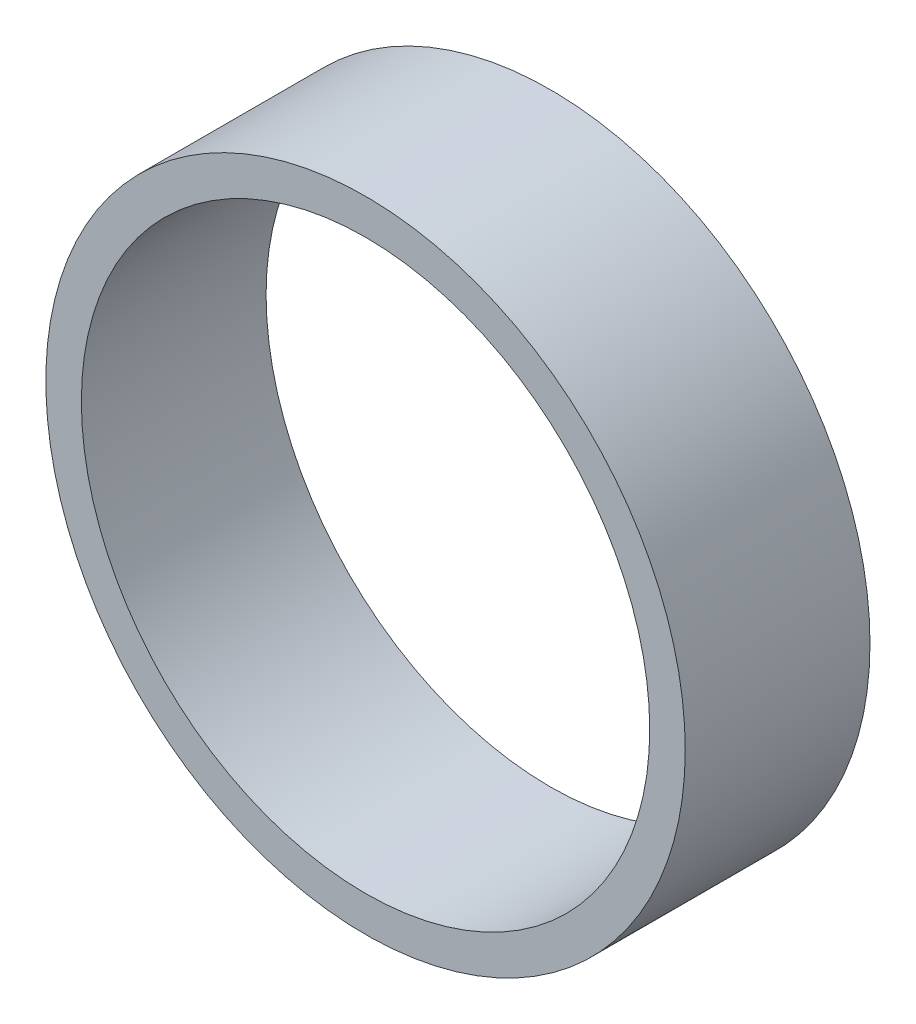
from build123d import *

# Parameters (mm, degrees)
ESQUISSE1_R        = 22.5
ESQUISSE1_R_2      = 20
EXTRU_MINCE1_DEPTH = 13


with BuildPart() as part:
    # Esquisse1 → Extru.-Mince1 (new body)
    with BuildSketch(Plane.XY):
        Circle(ESQUISSE1_R)
        Circle(ESQUISSE1_R_2, mode=Mode.SUBTRACT)
    extrude(amount=-EXTRU_MINCE1_DEPTH)


solid = part.part
